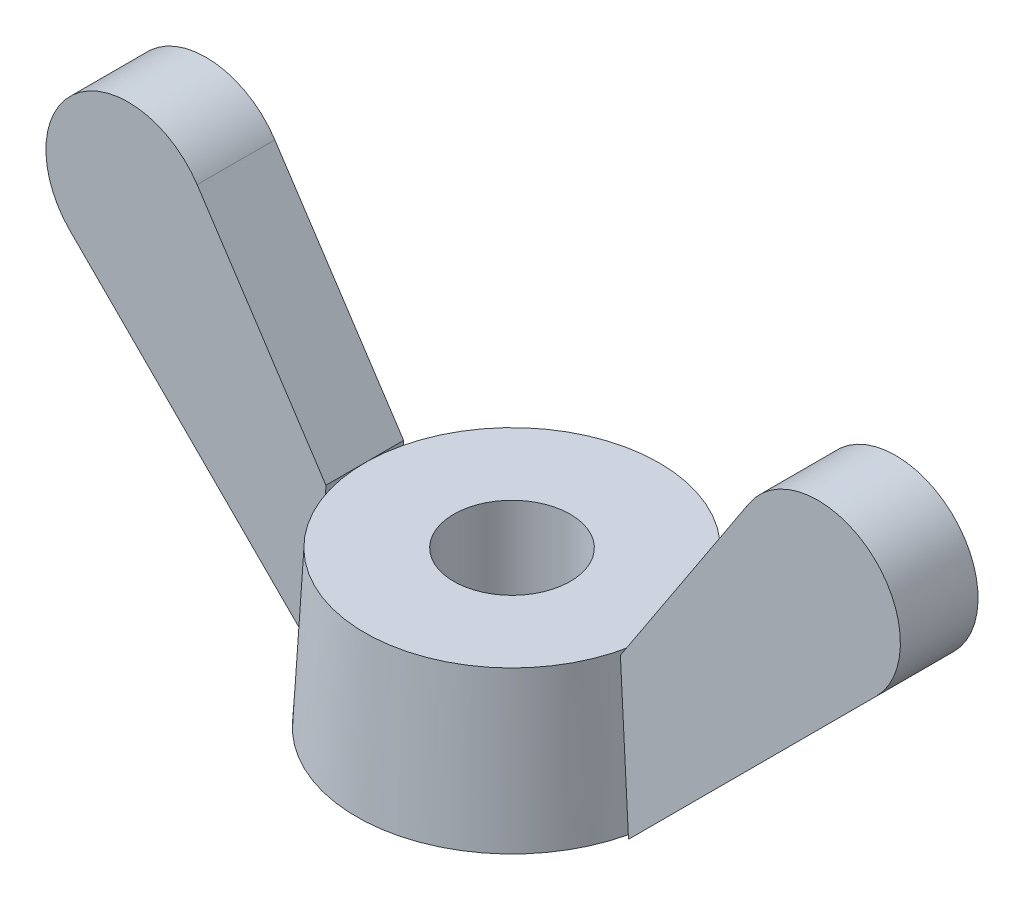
ISO-10303-21;
HEADER;
FILE_DESCRIPTION(('STEP AP214'),'2;1');
FILE_NAME('part.step','',(''),(''),'','','');
FILE_SCHEMA(('AUTOMOTIVE_DESIGN { 1 0 10303 214 1 1 1 1 }'));
ENDSEC;
DATA;
#1=APPLICATION_CONTEXT('core data for automotive mechanical design processes');
#2=APPLICATION_PROTOCOL_DEFINITION('international standard','automotive_design',2000,#1);
#3=PRODUCT_CONTEXT('',#1,'mechanical');
#4=PRODUCT('Part','Part','',(#3));
#5=PRODUCT_RELATED_PRODUCT_CATEGORY('part','',(#4));
#6=PRODUCT_DEFINITION_FORMATION('','',#4);
#7=PRODUCT_DEFINITION_CONTEXT('part definition',#1,'design');
#8=PRODUCT_DEFINITION('design','',#6,#7);
#9=PRODUCT_DEFINITION_SHAPE('','',#8);
#10=(LENGTH_UNIT() NAMED_UNIT(*) SI_UNIT(.MILLI.,.METRE.));
#11=(NAMED_UNIT(*) PLANE_ANGLE_UNIT() SI_UNIT($,.RADIAN.));
#12=(NAMED_UNIT(*) SI_UNIT($,.STERADIAN.) SOLID_ANGLE_UNIT());
#13=UNCERTAINTY_MEASURE_WITH_UNIT(LENGTH_MEASURE(1.E-05),#10,'distance_accuracy_value','');
#14=(GEOMETRIC_REPRESENTATION_CONTEXT(3) GLOBAL_UNCERTAINTY_ASSIGNED_CONTEXT((#13)) GLOBAL_UNIT_ASSIGNED_CONTEXT((#10,
#11,#12)) REPRESENTATION_CONTEXT('',''));
#15=CARTESIAN_POINT('',(0.,0.,0.));
#16=DIRECTION('',(0.,0.,1.));
#17=DIRECTION('',(1.,0.,0.));
#18=AXIS2_PLACEMENT_3D('',#15,#16,#17);
#19=CARTESIAN_POINT('',(3.79036888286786,4.,1.));
#20=DIRECTION('',(0.998629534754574,0.0523359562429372,0.));
#21=DIRECTION('',(-0.0523359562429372,0.998629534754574,0.));
#22=AXIS2_PLACEMENT_3D('',#19,#20,#21);
#23=PLANE('',#22);
#24=DIRECTION('',(0.0523359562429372,-0.998629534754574,0.));
#25=VECTOR('',#24,1.);
#26=CARTESIAN_POINT('',(3.79036888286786,4.,-1.));
#27=LINE('',#26,#25);
#28=CARTESIAN_POINT('',(3.79036888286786,4.,-1.));
#29=VERTEX_POINT('',#28);
#30=CARTESIAN_POINT('',(4.,0.,-1.));
#31=VERTEX_POINT('',#30);
#32=EDGE_CURVE('E106',#29,#31,#27,.T.);
#33=ORIENTED_EDGE('',*,*,#32,.T.);
#34=DIRECTION('',(0.,0.,-1.));
#35=VECTOR('',#34,1.);
#36=CARTESIAN_POINT('',(4.,0.,1.));
#37=LINE('',#36,#35);
#38=CARTESIAN_POINT('',(4.,0.,1.));
#39=VERTEX_POINT('',#38);
#40=EDGE_CURVE('E12',#39,#31,#37,.T.);
#41=ORIENTED_EDGE('',*,*,#40,.F.);
#42=DIRECTION('',(0.0523359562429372,-0.998629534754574,0.));
#43=VECTOR('',#42,1.);
#44=CARTESIAN_POINT('',(3.79036888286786,4.,1.));
#45=LINE('',#44,#43);
#46=CARTESIAN_POINT('',(3.79036888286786,4.,1.));
#47=VERTEX_POINT('',#46);
#48=EDGE_CURVE('E94',#47,#39,#45,.T.);
#49=ORIENTED_EDGE('',*,*,#48,.F.);
#50=DIRECTION('',(0.,0.,-1.));
#51=VECTOR('',#50,1.);
#52=CARTESIAN_POINT('',(3.79036888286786,4.,1.));
#53=LINE('',#52,#51);
#54=EDGE_CURVE('E102',#47,#29,#53,.T.);
#55=ORIENTED_EDGE('',*,*,#54,.T.);
#56=EDGE_LOOP('',(#33,#41,#49,#55));
#57=FACE_BOUND('',#56,.T.);
#58=ADVANCED_FACE('F43',(#57),#23,.F.);
#59=CARTESIAN_POINT('',(10.3786796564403,6.37867965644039,1.));
#60=DIRECTION('',(-0.707106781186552,0.707106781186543,0.));
#61=DIRECTION('',(-0.707106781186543,-0.707106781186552,0.));
#62=AXIS2_PLACEMENT_3D('',#59,#60,#61);
#63=PLANE('',#62);
#64=DIRECTION('',(0.707106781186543,0.707106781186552,0.));
#65=VECTOR('',#64,1.);
#66=CARTESIAN_POINT('',(10.3786796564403,6.37867965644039,-1.));
#67=LINE('',#66,#65);
#68=CARTESIAN_POINT('',(10.3786796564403,6.37867965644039,-1.));
#69=VERTEX_POINT('',#68);
#70=EDGE_CURVE('E98',#31,#69,#67,.T.);
#71=ORIENTED_EDGE('',*,*,#70,.T.);
#72=DIRECTION('',(0.,0.,-1.));
#73=VECTOR('',#72,1.);
#74=CARTESIAN_POINT('',(10.3786796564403,6.37867965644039,1.));
#75=LINE('',#74,#73);
#76=CARTESIAN_POINT('',(10.3786796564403,6.37867965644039,1.));
#77=VERTEX_POINT('',#76);
#78=EDGE_CURVE('E51',#77,#69,#75,.T.);
#79=ORIENTED_EDGE('',*,*,#78,.F.);
#80=DIRECTION('',(0.707106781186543,0.707106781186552,0.));
#81=VECTOR('',#80,1.);
#82=CARTESIAN_POINT('',(10.3786796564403,6.37867965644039,1.));
#83=LINE('',#82,#81);
#84=EDGE_CURVE('E89',#39,#77,#83,.T.);
#85=ORIENTED_EDGE('',*,*,#84,.F.);
#86=ORIENTED_EDGE('',*,*,#40,.T.);
#87=EDGE_LOOP('',(#71,#79,#85,#86));
#88=FACE_BOUND('',#87,.T.);
#89=ADVANCED_FACE('F97',(#88),#63,.F.);
#90=CARTESIAN_POINT('',(8.87867965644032,7.87867965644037,1.));
#91=DIRECTION('',(0.,0.,-1.));
#92=DIRECTION('',(-1.,0.,0.));
#93=AXIS2_PLACEMENT_3D('',#90,#91,#92);
#94=CYLINDRICAL_SURFACE('',#93,2.12132034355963);
#95=CARTESIAN_POINT('',(8.87867965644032,7.87867965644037,-1.));
#96=DIRECTION('',(0.,0.,1.));
#97=DIRECTION('',(1.,0.,0.));
#98=AXIS2_PLACEMENT_3D('',#95,#96,#97);
#99=CIRCLE('',#98,2.12132034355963);
#100=CARTESIAN_POINT('',(7.10605893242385,9.04393317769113,-1.));
#101=VERTEX_POINT('',#100);
#102=EDGE_CURVE('E76',#69,#101,#99,.T.);
#103=ORIENTED_EDGE('',*,*,#102,.T.);
#104=DIRECTION('',(0.,0.,-1.));
#105=VECTOR('',#104,1.);
#106=CARTESIAN_POINT('',(7.10605893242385,9.04393317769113,1.));
#107=LINE('',#106,#105);
#108=CARTESIAN_POINT('',(7.10605893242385,9.04393317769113,1.));
#109=VERTEX_POINT('',#108);
#110=EDGE_CURVE('E99',#109,#101,#107,.T.);
#111=ORIENTED_EDGE('',*,*,#110,.F.);
#112=CARTESIAN_POINT('',(8.87867965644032,7.87867965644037,1.));
#113=DIRECTION('',(0.,0.,1.));
#114=DIRECTION('',(1.,0.,0.));
#115=AXIS2_PLACEMENT_3D('',#112,#113,#114);
#116=CIRCLE('',#115,2.12132034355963);
#117=EDGE_CURVE('E92',#77,#109,#116,.T.);
#118=ORIENTED_EDGE('',*,*,#117,.F.);
#119=ORIENTED_EDGE('',*,*,#78,.T.);
#120=EDGE_LOOP('',(#103,#111,#118,#119));
#121=FACE_BOUND('',#120,.T.);
#122=ADVANCED_FACE('F100',(#121),#94,.T.);
#123=CARTESIAN_POINT('',(3.79036888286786,4.,1.));
#124=DIRECTION('',(0.835621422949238,-0.54930577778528,0.));
#125=DIRECTION('',(0.54930577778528,0.835621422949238,0.));
#126=AXIS2_PLACEMENT_3D('',#123,#124,#125);
#127=PLANE('',#126);
#128=DIRECTION('',(-0.54930577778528,-0.835621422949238,0.));
#129=VECTOR('',#128,1.);
#130=CARTESIAN_POINT('',(3.79036888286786,4.,-1.));
#131=LINE('',#130,#129);
#132=EDGE_CURVE('E82',#101,#29,#131,.T.);
#133=ORIENTED_EDGE('',*,*,#132,.T.);
#134=ORIENTED_EDGE('',*,*,#54,.F.);
#135=DIRECTION('',(-0.54930577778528,-0.835621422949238,0.));
#136=VECTOR('',#135,1.);
#137=CARTESIAN_POINT('',(3.79036888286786,4.,1.));
#138=LINE('',#137,#136);
#139=EDGE_CURVE('E59',#109,#47,#138,.T.);
#140=ORIENTED_EDGE('',*,*,#139,.F.);
#141=ORIENTED_EDGE('',*,*,#110,.T.);
#142=EDGE_LOOP('',(#133,#134,#140,#141));
#143=FACE_BOUND('',#142,.T.);
#144=ADVANCED_FACE('F113',(#143),#127,.F.);
#145=CARTESIAN_POINT('',(8.87867965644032,7.87867965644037,1.));
#146=DIRECTION('',(0.,0.,1.));
#147=DIRECTION('',(1.,0.,0.));
#148=AXIS2_PLACEMENT_3D('',#145,#146,#147);
#149=PLANE('',#148);
#150=ORIENTED_EDGE('',*,*,#48,.T.);
#151=ORIENTED_EDGE('',*,*,#84,.T.);
#152=ORIENTED_EDGE('',*,*,#117,.T.);
#153=ORIENTED_EDGE('',*,*,#139,.T.);
#154=EDGE_LOOP('',(#150,#151,#152,#153));
#155=FACE_BOUND('',#154,.T.);
#156=ADVANCED_FACE('F90',(#155),#149,.T.);
#157=CARTESIAN_POINT('',(8.87867965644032,7.87867965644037,-1.));
#158=DIRECTION('',(0.,0.,1.));
#159=DIRECTION('',(1.,0.,0.));
#160=AXIS2_PLACEMENT_3D('',#157,#158,#159);
#161=PLANE('',#160);
#162=ORIENTED_EDGE('',*,*,#32,.F.);
#163=ORIENTED_EDGE('',*,*,#132,.F.);
#164=ORIENTED_EDGE('',*,*,#102,.F.);
#165=ORIENTED_EDGE('',*,*,#70,.F.);
#166=EDGE_LOOP('',(#162,#163,#164,#165));
#167=FACE_BOUND('',#166,.T.);
#168=ADVANCED_FACE('F116',(#167),#161,.F.);
#169=CLOSED_SHELL('',(#58,#89,#122,#144,#156,#168));
#170=MANIFOLD_SOLID_BREP('B2',#169);
#171=CARTESIAN_POINT('',(-3.79036888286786,4.,1.));
#172=DIRECTION('',(-0.998629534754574,0.0523359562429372,0.));
#173=DIRECTION('',(-0.0523359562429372,-0.998629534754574,0.));
#174=AXIS2_PLACEMENT_3D('',#171,#172,#173);
#175=PLANE('',#174);
#176=DIRECTION('',(0.0523359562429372,0.998629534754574,0.));
#177=VECTOR('',#176,1.);
#178=CARTESIAN_POINT('',(-3.79036888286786,4.,-1.));
#179=LINE('',#178,#177);
#180=CARTESIAN_POINT('',(-4.,0.,-1.));
#181=VERTEX_POINT('',#180);
#182=CARTESIAN_POINT('',(-3.79036888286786,4.,-1.));
#183=VERTEX_POINT('',#182);
#184=EDGE_CURVE('E236',#181,#183,#179,.T.);
#185=ORIENTED_EDGE('',*,*,#184,.T.);
#186=DIRECTION('',(0.,0.,-1.));
#187=VECTOR('',#186,1.);
#188=CARTESIAN_POINT('',(-3.79036888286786,4.,1.));
#189=LINE('',#188,#187);
#190=CARTESIAN_POINT('',(-3.79036888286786,4.,1.));
#191=VERTEX_POINT('',#190);
#192=EDGE_CURVE('E41',#191,#183,#189,.T.);
#193=ORIENTED_EDGE('',*,*,#192,.F.);
#194=DIRECTION('',(0.0523359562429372,0.998629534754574,0.));
#195=VECTOR('',#194,1.);
#196=CARTESIAN_POINT('',(-3.79036888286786,4.,1.));
#197=LINE('',#196,#195);
#198=CARTESIAN_POINT('',(-4.,0.,1.));
#199=VERTEX_POINT('',#198);
#200=EDGE_CURVE('E224',#199,#191,#197,.T.);
#201=ORIENTED_EDGE('',*,*,#200,.F.);
#202=DIRECTION('',(0.,0.,-1.));
#203=VECTOR('',#202,1.);
#204=CARTESIAN_POINT('',(-4.,0.,1.));
#205=LINE('',#204,#203);
#206=EDGE_CURVE('E232',#199,#181,#205,.T.);
#207=ORIENTED_EDGE('',*,*,#206,.T.);
#208=EDGE_LOOP('',(#185,#193,#201,#207));
#209=FACE_BOUND('',#208,.T.);
#210=ADVANCED_FACE('F173',(#209),#175,.F.);
#211=CARTESIAN_POINT('',(-3.79036888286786,4.,1.));
#212=DIRECTION('',(-0.835621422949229,-0.549305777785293,0.));
#213=DIRECTION('',(0.549305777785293,-0.835621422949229,0.));
#214=AXIS2_PLACEMENT_3D('',#211,#212,#213);
#215=PLANE('',#214);
#216=DIRECTION('',(-0.549305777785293,0.835621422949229,0.));
#217=VECTOR('',#216,1.);
#218=CARTESIAN_POINT('',(-3.79036888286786,4.,-1.));
#219=LINE('',#218,#217);
#220=CARTESIAN_POINT('',(-7.10605893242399,9.04393317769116,-1.));
#221=VERTEX_POINT('',#220);
#222=EDGE_CURVE('E228',#183,#221,#219,.T.);
#223=ORIENTED_EDGE('',*,*,#222,.T.);
#224=DIRECTION('',(0.,0.,-1.));
#225=VECTOR('',#224,1.);
#226=CARTESIAN_POINT('',(-7.10605893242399,9.04393317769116,1.));
#227=LINE('',#226,#225);
#228=CARTESIAN_POINT('',(-7.10605893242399,9.04393317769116,1.));
#229=VERTEX_POINT('',#228);
#230=EDGE_CURVE('E181',#229,#221,#227,.T.);
#231=ORIENTED_EDGE('',*,*,#230,.F.);
#232=DIRECTION('',(-0.549305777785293,0.835621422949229,0.));
#233=VECTOR('',#232,1.);
#234=CARTESIAN_POINT('',(-3.79036888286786,4.,1.));
#235=LINE('',#234,#233);
#236=EDGE_CURVE('E219',#191,#229,#235,.T.);
#237=ORIENTED_EDGE('',*,*,#236,.F.);
#238=ORIENTED_EDGE('',*,*,#192,.T.);
#239=EDGE_LOOP('',(#223,#231,#237,#238));
#240=FACE_BOUND('',#239,.T.);
#241=ADVANCED_FACE('F227',(#240),#215,.F.);
#242=CARTESIAN_POINT('',(-8.87867965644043,7.87867965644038,1.));
#243=DIRECTION('',(0.,0.,-1.));
#244=DIRECTION('',(-1.,0.,0.));
#245=AXIS2_PLACEMENT_3D('',#242,#243,#244);
#246=CYLINDRICAL_SURFACE('',#245,2.12132034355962);
#247=CARTESIAN_POINT('',(-8.87867965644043,7.87867965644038,-1.));
#248=DIRECTION('',(0.,0.,1.));
#249=DIRECTION('',(1.,0.,0.));
#250=AXIS2_PLACEMENT_3D('',#247,#248,#249);
#251=CIRCLE('',#250,2.12132034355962);
#252=CARTESIAN_POINT('',(-10.3786796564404,6.37867965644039,-1.));
#253=VERTEX_POINT('',#252);
#254=EDGE_CURVE('E206',#221,#253,#251,.T.);
#255=ORIENTED_EDGE('',*,*,#254,.T.);
#256=DIRECTION('',(0.,0.,-1.));
#257=VECTOR('',#256,1.);
#258=CARTESIAN_POINT('',(-10.3786796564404,6.37867965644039,1.));
#259=LINE('',#258,#257);
#260=CARTESIAN_POINT('',(-10.3786796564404,6.37867965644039,1.));
#261=VERTEX_POINT('',#260);
#262=EDGE_CURVE('E229',#261,#253,#259,.T.);
#263=ORIENTED_EDGE('',*,*,#262,.F.);
#264=CARTESIAN_POINT('',(-8.87867965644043,7.87867965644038,1.));
#265=DIRECTION('',(0.,0.,1.));
#266=DIRECTION('',(1.,0.,0.));
#267=AXIS2_PLACEMENT_3D('',#264,#265,#266);
#268=CIRCLE('',#267,2.12132034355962);
#269=EDGE_CURVE('E222',#229,#261,#268,.T.);
#270=ORIENTED_EDGE('',*,*,#269,.F.);
#271=ORIENTED_EDGE('',*,*,#230,.T.);
#272=EDGE_LOOP('',(#255,#263,#270,#271));
#273=FACE_BOUND('',#272,.T.);
#274=ADVANCED_FACE('F230',(#273),#246,.T.);
#275=CARTESIAN_POINT('',(-10.3786796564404,6.37867965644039,1.));
#276=DIRECTION('',(0.707106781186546,0.707106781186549,0.));
#277=DIRECTION('',(-0.707106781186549,0.707106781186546,0.));
#278=AXIS2_PLACEMENT_3D('',#275,#276,#277);
#279=PLANE('',#278);
#280=DIRECTION('',(0.707106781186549,-0.707106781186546,0.));
#281=VECTOR('',#280,1.);
#282=CARTESIAN_POINT('',(-10.3786796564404,6.37867965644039,-1.));
#283=LINE('',#282,#281);
#284=EDGE_CURVE('E212',#253,#181,#283,.T.);
#285=ORIENTED_EDGE('',*,*,#284,.T.);
#286=ORIENTED_EDGE('',*,*,#206,.F.);
#287=DIRECTION('',(0.707106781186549,-0.707106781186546,0.));
#288=VECTOR('',#287,1.);
#289=CARTESIAN_POINT('',(-10.3786796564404,6.37867965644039,1.));
#290=LINE('',#289,#288);
#291=EDGE_CURVE('E189',#261,#199,#290,.T.);
#292=ORIENTED_EDGE('',*,*,#291,.F.);
#293=ORIENTED_EDGE('',*,*,#262,.T.);
#294=EDGE_LOOP('',(#285,#286,#292,#293));
#295=FACE_BOUND('',#294,.T.);
#296=ADVANCED_FACE('F243',(#295),#279,.F.);
#297=CARTESIAN_POINT('',(-8.87867965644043,7.87867965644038,1.));
#298=DIRECTION('',(0.,0.,1.));
#299=DIRECTION('',(1.,0.,0.));
#300=AXIS2_PLACEMENT_3D('',#297,#298,#299);
#301=PLANE('',#300);
#302=ORIENTED_EDGE('',*,*,#200,.T.);
#303=ORIENTED_EDGE('',*,*,#236,.T.);
#304=ORIENTED_EDGE('',*,*,#269,.T.);
#305=ORIENTED_EDGE('',*,*,#291,.T.);
#306=EDGE_LOOP('',(#302,#303,#304,#305));
#307=FACE_BOUND('',#306,.T.);
#308=ADVANCED_FACE('F220',(#307),#301,.T.);
#309=CARTESIAN_POINT('',(-8.87867965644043,7.87867965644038,-1.));
#310=DIRECTION('',(0.,0.,1.));
#311=DIRECTION('',(1.,0.,0.));
#312=AXIS2_PLACEMENT_3D('',#309,#310,#311);
#313=PLANE('',#312);
#314=ORIENTED_EDGE('',*,*,#184,.F.);
#315=ORIENTED_EDGE('',*,*,#284,.F.);
#316=ORIENTED_EDGE('',*,*,#254,.F.);
#317=ORIENTED_EDGE('',*,*,#222,.F.);
#318=EDGE_LOOP('',(#314,#315,#316,#317));
#319=FACE_BOUND('',#318,.T.);
#320=ADVANCED_FACE('F246',(#319),#313,.F.);
#321=CLOSED_SHELL('',(#210,#241,#274,#296,#308,#320));
#322=MANIFOLD_SOLID_BREP('B6',#321);
#323=CARTESIAN_POINT('',(0.,0.,0.));
#324=DIRECTION('',(0.,-1.,0.));
#325=DIRECTION('',(0.,0.,-1.));
#326=AXIS2_PLACEMENT_3D('',#323,#324,#325);
#327=CONICAL_SURFACE('',#326,4.,0.0523598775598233);
#328=CARTESIAN_POINT('',(0.,4.,0.));
#329=DIRECTION('',(0.,-1.,0.));
#330=DIRECTION('',(0.,0.,-1.));
#331=AXIS2_PLACEMENT_3D('',#328,#329,#330);
#332=CIRCLE('',#331,3.79036888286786);
#333=CARTESIAN_POINT('',(0.,4.,-3.79036888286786));
#334=VERTEX_POINT('',#333);
#335=EDGE_CURVE('E172',#334,#334,#332,.T.);
#336=ORIENTED_EDGE('',*,*,#335,.T.);
#337=EDGE_LOOP('',(#336));
#338=FACE_BOUND('',#337,.T.);
#339=CARTESIAN_POINT('',(0.,0.,0.));
#340=DIRECTION('',(0.,-1.,0.));
#341=DIRECTION('',(0.,0.,-1.));
#342=AXIS2_PLACEMENT_3D('',#339,#340,#341);
#343=CIRCLE('',#342,4.);
#344=CARTESIAN_POINT('',(0.,0.,-4.));
#345=VERTEX_POINT('',#344);
#346=EDGE_CURVE('E310',#345,#345,#343,.T.);
#347=ORIENTED_EDGE('',*,*,#346,.F.);
#348=EDGE_LOOP('',(#347));
#349=FACE_BOUND('',#348,.T.);
#350=ADVANCED_FACE('F296',(#338,#349),#327,.T.);
#351=CARTESIAN_POINT('',(3.79036888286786,4.,0.));
#352=DIRECTION('',(0.,1.,0.));
#353=DIRECTION('',(0.,0.,1.));
#354=AXIS2_PLACEMENT_3D('',#351,#352,#353);
#355=PLANE('',#354);
#356=CARTESIAN_POINT('',(0.,4.,0.));
#357=DIRECTION('',(0.,-1.,0.));
#358=DIRECTION('',(0.,0.,-1.));
#359=AXIS2_PLACEMENT_3D('',#356,#357,#358);
#360=CIRCLE('',#359,1.5);
#361=CARTESIAN_POINT('',(0.,4.,-1.5));
#362=VERTEX_POINT('',#361);
#363=EDGE_CURVE('E302',#362,#362,#360,.T.);
#364=ORIENTED_EDGE('',*,*,#363,.T.);
#365=EDGE_LOOP('',(#364));
#366=FACE_BOUND('',#365,.T.);
#367=ORIENTED_EDGE('',*,*,#335,.F.);
#368=EDGE_LOOP('',(#367));
#369=FACE_BOUND('',#368,.T.);
#370=ADVANCED_FACE('F320',(#366,#369),#355,.T.);
#371=CARTESIAN_POINT('',(0.,0.,0.));
#372=DIRECTION('',(0.,-1.,0.));
#373=DIRECTION('',(0.,0.,-1.));
#374=AXIS2_PLACEMENT_3D('',#371,#372,#373);
#375=CYLINDRICAL_SURFACE('',#374,1.5);
#376=CARTESIAN_POINT('',(0.,0.,0.));
#377=DIRECTION('',(0.,-1.,0.));
#378=DIRECTION('',(0.,0.,-1.));
#379=AXIS2_PLACEMENT_3D('',#376,#377,#378);
#380=CIRCLE('',#379,1.5);
#381=CARTESIAN_POINT('',(0.,0.,-1.5));
#382=VERTEX_POINT('',#381);
#383=EDGE_CURVE('E306',#382,#382,#380,.T.);
#384=ORIENTED_EDGE('',*,*,#383,.T.);
#385=EDGE_LOOP('',(#384));
#386=FACE_BOUND('',#385,.T.);
#387=ORIENTED_EDGE('',*,*,#363,.F.);
#388=EDGE_LOOP('',(#387));
#389=FACE_BOUND('',#388,.T.);
#390=ADVANCED_FACE('F324',(#386,#389),#375,.F.);
#391=CARTESIAN_POINT('',(1.5,0.,0.));
#392=DIRECTION('',(0.,-1.,0.));
#393=DIRECTION('',(0.,0.,-1.));
#394=AXIS2_PLACEMENT_3D('',#391,#392,#393);
#395=PLANE('',#394);
#396=ORIENTED_EDGE('',*,*,#346,.T.);
#397=EDGE_LOOP('',(#396));
#398=FACE_BOUND('',#397,.T.);
#399=ORIENTED_EDGE('',*,*,#383,.F.);
#400=EDGE_LOOP('',(#399));
#401=FACE_BOUND('',#400,.T.);
#402=ADVANCED_FACE('F316',(#398,#401),#395,.T.);
#403=CLOSED_SHELL('',(#350,#370,#390,#402));
#404=MANIFOLD_SOLID_BREP('B35',#403);
#405=ADVANCED_BREP_SHAPE_REPRESENTATION('',(#18,#170,#322,#404),#14);
#406=SHAPE_DEFINITION_REPRESENTATION(#9,#405);
ENDSEC;
END-ISO-10303-21;
